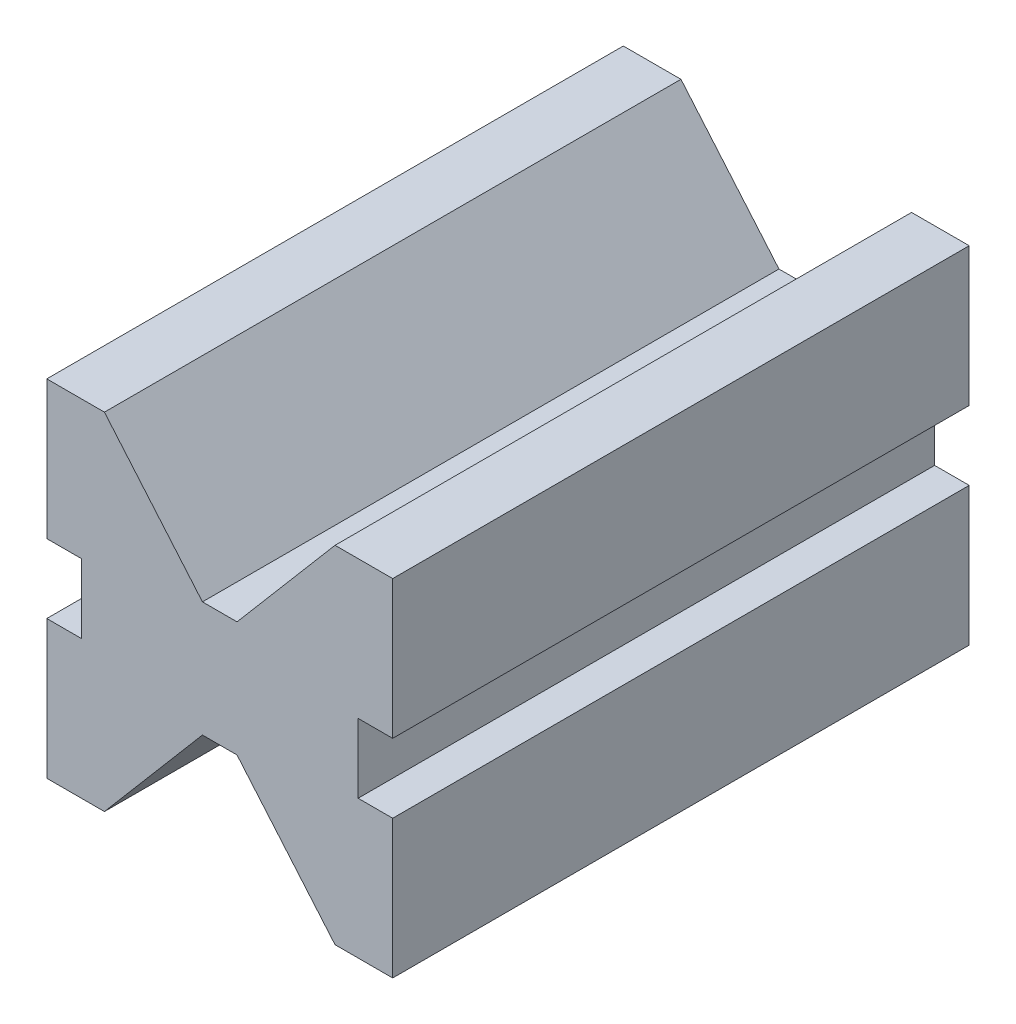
from build123d import *

# Parameters (mm, degrees)
BOSS_EXTRUDE1_DEPTH = 50


with BuildPart() as part:
    # Sketch1 → Boss-Extrude1 (new, symmetric)
    with BuildSketch(Plane.XY):
        Polygon((-3, -10), (3, -10), (20, -30), (30, -30), (30, -6), (24, -6), (24, 6), (30, 6), (30, 30), (20, 30), (3, 10), (-3, 10), (-20, 30), (-30, 30), (-30, 6), (-24, 6), (-24, -6), (-30, -6), (-30, -30), (-20, -30), align=None)
    extrude(amount=BOSS_EXTRUDE1_DEPTH, both=True)


solid = part.part
